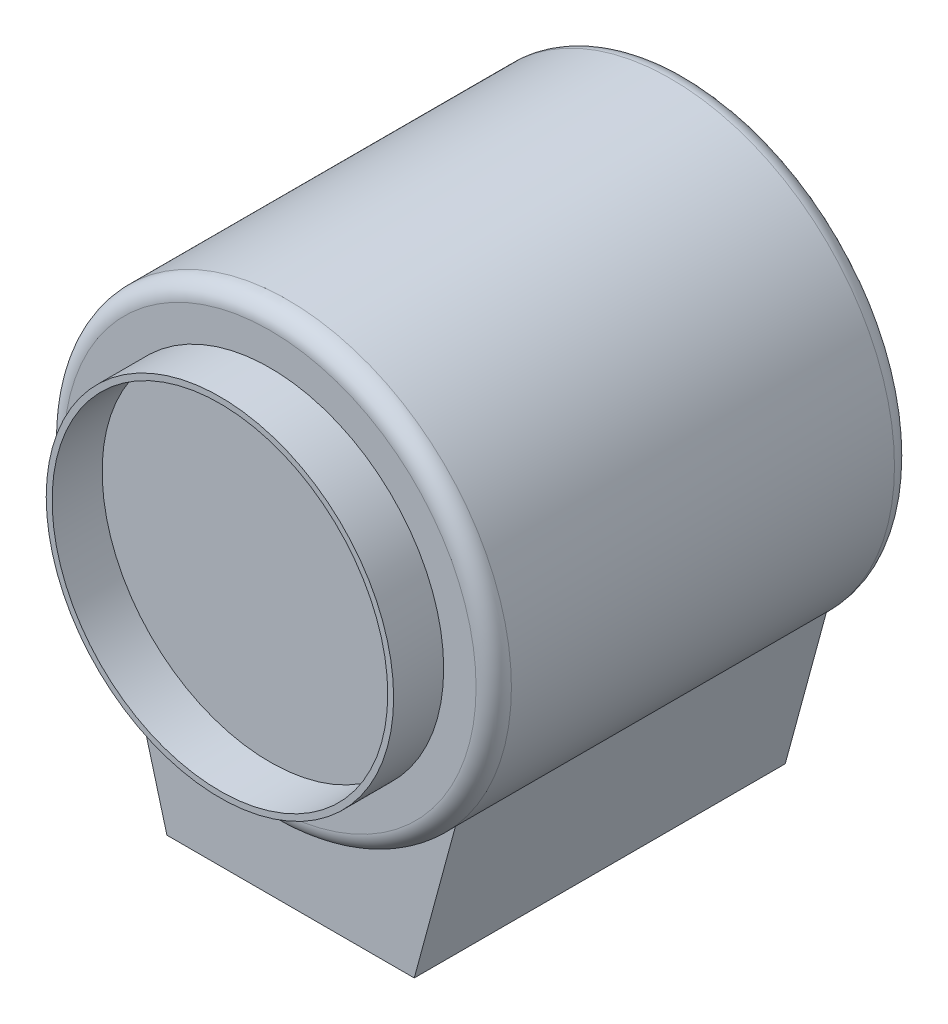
from build123d import *

# Parameters (mm, degrees)
SKETCH1_R           = 241.3
BOSS_EXTRUDE1_DEPTH = 222.25
FILLET1_R           = 19.05
SKETCH3_R           = 187.325
SKETCH3_R_2         = 180.975
BOSS_EXTRUDE2_DEPTH = 53.975
BOSS_EXTRUDE3_DEPTH = 200.025


with BuildPart() as part:
    # Sketch1 → Boss-Extrude1 (new, symmetric)
    with BuildSketch(Plane.XY):
        Circle(SKETCH1_R)
    extrude(amount=BOSS_EXTRUDE1_DEPTH, both=True)

    # Sketch2 → Revolve1 (revolve)
    with BuildSketch(Plane(origin=(0, 0, 0), x_dir=(1, 0, 0), z_dir=(0, 1, 0))):
        with BuildLine():
            Line((0, 222.25), (-241.3, 222.25))
            ThreePointArc((-241.3, 222.25), (-146.678471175, 256.098390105), (-47.625, 273.05))
            Line((-47.625, 273.05), (0, 273.05))
            Line((0, 273.05), (0, 222.25))
        make_face()
    revolve(axis=Axis((0, 0, -273.05), (0, 0, 1)))

    # Fillet1
    fillet1_edges = [part.edges().sort_by_distance(p)[0] for p in [
        (-241.3, 0, 222.25),
        (0, -241.3, -222.25),
    ]]
    fillet(fillet1_edges, radius=FILLET1_R)

    # Sketch3 → Boss-Extrude2 (add)
    with BuildSketch(Plane.XY.offset(222.25)):
        Circle(SKETCH3_R)
        Circle(SKETCH3_R_2, mode=Mode.SUBTRACT)
    extrude(amount=BOSS_EXTRUDE2_DEPTH)

    # Sketch4 → Boss-Extrude3 (add, symmetric)
    with BuildSketch(Plane.XY):
        with BuildLine():
            Line((-177.8, -163.134453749), (-133.35, -327.025))
            Line((-133.35, -327.025), (133.35, -327.025))
            Line((133.35, -327.025), (177.8, -163.134453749))
            ThreePointArc((177.8, -163.134453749), (0, -241.3), (-177.8, -163.134453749))
        make_face()
    extrude(amount=BOSS_EXTRUDE3_DEPTH, both=True)


solid = part.part
